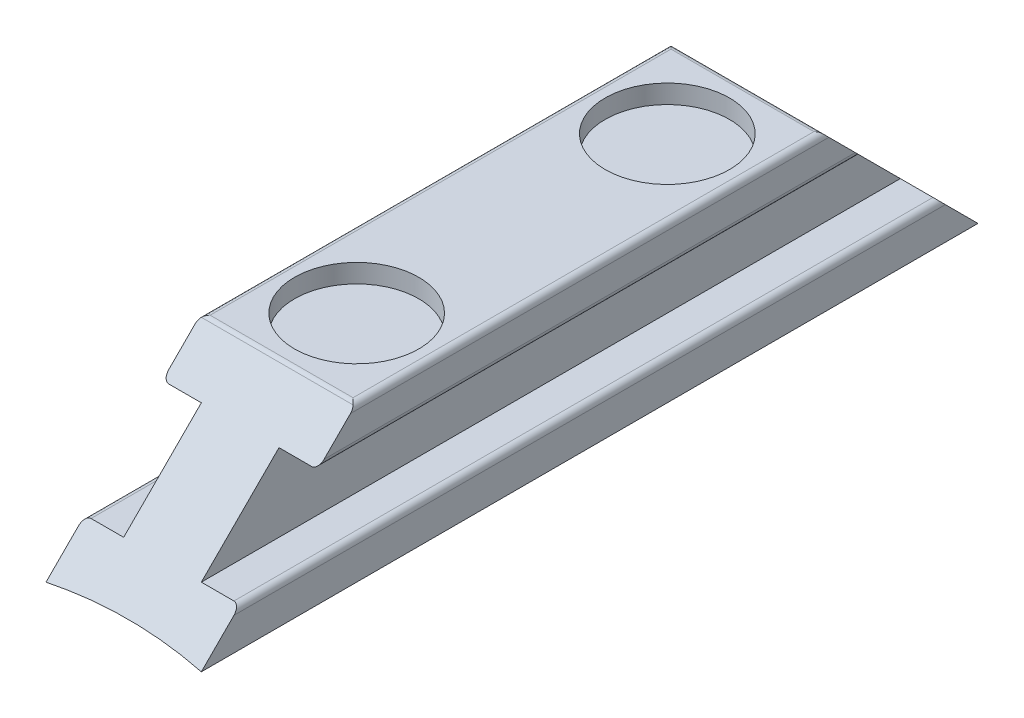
ISO-10303-21;
HEADER;
FILE_DESCRIPTION(('STEP AP214'),'2;1');
FILE_NAME('part.step','',(''),(''),'','','');
FILE_SCHEMA(('AUTOMOTIVE_DESIGN { 1 0 10303 214 1 1 1 1 }'));
ENDSEC;
DATA;
#1=APPLICATION_CONTEXT('core data for automotive mechanical design processes');
#2=APPLICATION_PROTOCOL_DEFINITION('international standard','automotive_design',2000,#1);
#3=PRODUCT_CONTEXT('',#1,'mechanical');
#4=PRODUCT('Part','Part','',(#3));
#5=PRODUCT_RELATED_PRODUCT_CATEGORY('part','',(#4));
#6=PRODUCT_DEFINITION_FORMATION('','',#4);
#7=PRODUCT_DEFINITION_CONTEXT('part definition',#1,'design');
#8=PRODUCT_DEFINITION('design','',#6,#7);
#9=PRODUCT_DEFINITION_SHAPE('','',#8);
#10=(LENGTH_UNIT() NAMED_UNIT(*) SI_UNIT(.MILLI.,.METRE.));
#11=(NAMED_UNIT(*) PLANE_ANGLE_UNIT() SI_UNIT($,.RADIAN.));
#12=(NAMED_UNIT(*) SI_UNIT($,.STERADIAN.) SOLID_ANGLE_UNIT());
#13=UNCERTAINTY_MEASURE_WITH_UNIT(LENGTH_MEASURE(1.E-05),#10,'distance_accuracy_value','');
#14=(GEOMETRIC_REPRESENTATION_CONTEXT(3) GLOBAL_UNCERTAINTY_ASSIGNED_CONTEXT((#13)) GLOBAL_UNIT_ASSIGNED_CONTEXT((#10,
#11,#12)) REPRESENTATION_CONTEXT('',''));
#15=CARTESIAN_POINT('',(0.,0.,0.));
#16=DIRECTION('',(0.,0.,1.));
#17=DIRECTION('',(1.,0.,0.));
#18=AXIS2_PLACEMENT_3D('',#15,#16,#17);
#19=CARTESIAN_POINT('',(84.3312531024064,0.,0.));
#20=DIRECTION('',(0.,0.707106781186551,-0.707106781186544));
#21=DIRECTION('',(0.,0.707106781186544,0.707106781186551));
#22=AXIS2_PLACEMENT_3D('',#19,#20,#21);
#23=PLANE('',#22);
#24=DIRECTION('',(0.,-0.707106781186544,-0.707106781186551));
#25=VECTOR('',#24,1.);
#26=CARTESIAN_POINT('',(-17.2687468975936,0.,0.));
#27=LINE('',#26,#25);
#28=CARTESIAN_POINT('',(-17.2687468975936,1.3335,1.33350000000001));
#29=VERTEX_POINT('',#28);
#30=CARTESIAN_POINT('',(-17.2687468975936,0.,0.));
#31=VERTEX_POINT('',#30);
#32=EDGE_CURVE('E564',#29,#31,#27,.T.);
#33=ORIENTED_EDGE('',*,*,#32,.F.);
#34=CARTESIAN_POINT('',(-17.0147468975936,1.3335,1.33350000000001));
#35=DIRECTION('',(0.,0.707106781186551,-0.707106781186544));
#36=DIRECTION('',(0.,0.707106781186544,0.707106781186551));
#37=AXIS2_PLACEMENT_3D('',#34,#35,#36);
#38=ELLIPSE('',#37,0.359210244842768,0.254);
#39=CARTESIAN_POINT('',(-17.0147468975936,1.5875,1.58750000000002));
#40=VERTEX_POINT('',#39);
#41=EDGE_CURVE('E223',#29,#40,#38,.T.);
#42=ORIENTED_EDGE('',*,*,#41,.T.);
#43=DIRECTION('',(-1.,0.,0.));
#44=VECTOR('',#43,1.);
#45=CARTESIAN_POINT('',(-14.0937468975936,1.5875,1.58750000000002));
#46=LINE('',#45,#44);
#47=CARTESIAN_POINT('',(-15.6812468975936,1.5875,1.58750000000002));
#48=VERTEX_POINT('',#47);
#49=EDGE_CURVE('E568',#48,#40,#46,.T.);
#50=ORIENTED_EDGE('',*,*,#49,.F.);
#51=DIRECTION('',(0.,-0.707106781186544,-0.707106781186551));
#52=VECTOR('',#51,1.);
#53=CARTESIAN_POINT('',(-15.6812468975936,13.8992893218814,13.8992893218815));
#54=LINE('',#53,#52);
#55=CARTESIAN_POINT('',(-15.6812468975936,4.7625,4.76250000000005));
#56=VERTEX_POINT('',#55);
#57=EDGE_CURVE('E571',#56,#48,#54,.T.);
#58=ORIENTED_EDGE('',*,*,#57,.F.);
#59=DIRECTION('',(-1.,0.,0.));
#60=VECTOR('',#59,1.);
#61=CARTESIAN_POINT('',(-14.0937468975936,4.7625,4.76250000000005));
#62=LINE('',#61,#60);
#63=CARTESIAN_POINT('',(-17.0147468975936,4.7625,4.76250000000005));
#64=VERTEX_POINT('',#63);
#65=EDGE_CURVE('E574',#56,#64,#62,.T.);
#66=ORIENTED_EDGE('',*,*,#65,.T.);
#67=CARTESIAN_POINT('',(-17.0147468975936,5.0165,5.01650000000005));
#68=DIRECTION('',(0.,0.707106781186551,-0.707106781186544));
#69=DIRECTION('',(0.,0.707106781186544,0.707106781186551));
#70=AXIS2_PLACEMENT_3D('',#67,#68,#69);
#71=ELLIPSE('',#70,0.359210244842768,0.254);
#72=CARTESIAN_POINT('',(-17.2687468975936,5.0165,5.01650000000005));
#73=VERTEX_POINT('',#72);
#74=EDGE_CURVE('E221',#64,#73,#71,.T.);
#75=ORIENTED_EDGE('',*,*,#74,.T.);
#76=CARTESIAN_POINT('',(-17.2687468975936,6.096,6.09600000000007));
#77=VERTEX_POINT('',#76);
#78=EDGE_CURVE('E565',#77,#73,#27,.T.);
#79=ORIENTED_EDGE('',*,*,#78,.F.);
#80=CARTESIAN_POINT('',(-17.0147468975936,6.096,6.09600000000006));
#81=DIRECTION('',(0.,0.707106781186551,-0.707106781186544));
#82=DIRECTION('',(0.,-0.707106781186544,-0.707106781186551));
#83=AXIS2_PLACEMENT_3D('',#80,#81,#82);
#84=ELLIPSE('',#83,0.359210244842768,0.254);
#85=CARTESIAN_POINT('',(-17.194352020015,6.27560512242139,6.27560512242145));
#86=VERTEX_POINT('',#85);
#87=EDGE_CURVE('E211',#77,#86,#84,.T.);
#88=ORIENTED_EDGE('',*,*,#87,.T.);
#89=DIRECTION('',(-1.,0.,0.));
#90=VECTOR('',#89,1.);
#91=CARTESIAN_POINT('',(84.3312531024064,6.27560512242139,6.27560512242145));
#92=LINE('',#91,#90);
#93=CARTESIAN_POINT('',(-10.9931417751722,6.27560512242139,6.27560512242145));
#94=VERTEX_POINT('',#93);
#95=EDGE_CURVE('E213',#86,#94,#92,.F.);
#96=ORIENTED_EDGE('',*,*,#95,.T.);
#97=CARTESIAN_POINT('',(-11.1727468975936,6.096,6.09600000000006));
#98=DIRECTION('',(0.,0.707106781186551,-0.707106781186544));
#99=DIRECTION('',(0.,-0.707106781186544,-0.707106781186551));
#100=AXIS2_PLACEMENT_3D('',#97,#98,#99);
#101=ELLIPSE('',#100,0.359210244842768,0.254);
#102=CARTESIAN_POINT('',(-10.9187468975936,6.096,6.09600000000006));
#103=VERTEX_POINT('',#102);
#104=EDGE_CURVE('E216',#94,#103,#101,.T.);
#105=ORIENTED_EDGE('',*,*,#104,.T.);
#106=DIRECTION('',(0.,0.707106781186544,0.707106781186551));
#107=VECTOR('',#106,1.);
#108=CARTESIAN_POINT('',(-10.9187468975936,13.8992893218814,13.8992893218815));
#109=LINE('',#108,#107);
#110=CARTESIAN_POINT('',(-10.9187468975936,5.0165,5.01650000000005));
#111=VERTEX_POINT('',#110);
#112=EDGE_CURVE('E577',#111,#103,#109,.T.);
#113=ORIENTED_EDGE('',*,*,#112,.F.);
#114=CARTESIAN_POINT('',(-11.1727468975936,5.0165,5.01650000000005));
#115=DIRECTION('',(0.,0.707106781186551,-0.707106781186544));
#116=DIRECTION('',(0.,-0.707106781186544,-0.707106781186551));
#117=AXIS2_PLACEMENT_3D('',#114,#115,#116);
#118=ELLIPSE('',#117,0.359210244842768,0.254);
#119=CARTESIAN_POINT('',(-11.1727468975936,4.7625,4.76250000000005));
#120=VERTEX_POINT('',#119);
#121=EDGE_CURVE('E219',#111,#120,#118,.T.);
#122=ORIENTED_EDGE('',*,*,#121,.T.);
#123=DIRECTION('',(1.,0.,0.));
#124=VECTOR('',#123,1.);
#125=CARTESIAN_POINT('',(-14.0937468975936,4.7625,4.76250000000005));
#126=LINE('',#125,#124);
#127=CARTESIAN_POINT('',(-12.5062468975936,4.7625,4.76250000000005));
#128=VERTEX_POINT('',#127);
#129=EDGE_CURVE('E268',#128,#120,#126,.T.);
#130=ORIENTED_EDGE('',*,*,#129,.F.);
#131=DIRECTION('',(0.,-0.707106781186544,-0.707106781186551));
#132=VECTOR('',#131,1.);
#133=CARTESIAN_POINT('',(-12.5062468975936,13.8992893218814,13.8992893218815));
#134=LINE('',#133,#132);
#135=CARTESIAN_POINT('',(-12.5062468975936,1.5875,1.58750000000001));
#136=VERTEX_POINT('',#135);
#137=EDGE_CURVE('E266',#128,#136,#134,.T.);
#138=ORIENTED_EDGE('',*,*,#137,.T.);
#139=DIRECTION('',(1.,0.,0.));
#140=VECTOR('',#139,1.);
#141=CARTESIAN_POINT('',(-14.0937468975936,1.5875,1.58750000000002));
#142=LINE('',#141,#140);
#143=CARTESIAN_POINT('',(-11.1727468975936,1.5875,1.58750000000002));
#144=VERTEX_POINT('',#143);
#145=EDGE_CURVE('E178',#136,#144,#142,.T.);
#146=ORIENTED_EDGE('',*,*,#145,.T.);
#147=CARTESIAN_POINT('',(-11.1727468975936,1.3335,1.33350000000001));
#148=DIRECTION('',(0.,0.707106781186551,-0.707106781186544));
#149=DIRECTION('',(0.,-0.707106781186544,-0.707106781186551));
#150=AXIS2_PLACEMENT_3D('',#147,#148,#149);
#151=ELLIPSE('',#150,0.359210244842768,0.254);
#152=CARTESIAN_POINT('',(-10.9187468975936,1.3335,1.33350000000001));
#153=VERTEX_POINT('',#152);
#154=EDGE_CURVE('E173',#144,#153,#151,.T.);
#155=ORIENTED_EDGE('',*,*,#154,.T.);
#156=DIRECTION('',(0.,-0.707106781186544,-0.707106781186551));
#157=VECTOR('',#156,1.);
#158=CARTESIAN_POINT('',(-10.9187468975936,13.8992893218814,13.8992893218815));
#159=LINE('',#158,#157);
#160=CARTESIAN_POINT('',(-10.9187468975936,0.,0.));
#161=VERTEX_POINT('',#160);
#162=EDGE_CURVE('E168',#153,#161,#159,.T.);
#163=ORIENTED_EDGE('',*,*,#162,.T.);
#164=CARTESIAN_POINT('',(-14.0937468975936,-27.599225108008,-27.5992251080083));
#165=DIRECTION('',(0.,0.707106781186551,-0.707106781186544));
#166=DIRECTION('',(0.,-0.707106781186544,-0.707106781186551));
#167=AXIS2_PLACEMENT_3D('',#164,#165,#166);
#168=ELLIPSE('',#167,39.2886205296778,27.78125);
#169=EDGE_CURVE('E171',#161,#31,#168,.F.);
#170=ORIENTED_EDGE('',*,*,#169,.T.);
#171=EDGE_LOOP('',(#33,#42,#50,#58,#66,#75,#79,#88,#96,#105,#113,#122,#130,#138,#146,#155,#163,#170));
#172=FACE_BOUND('',#171,.T.);
#173=ADVANCED_FACE('F33',(#172),#23,.T.);
#174=CARTESIAN_POINT('',(84.3312531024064,6.35,25.3999999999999));
#175=DIRECTION('',(0.,0.707106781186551,0.707106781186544));
#176=DIRECTION('',(0.,-0.707106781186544,0.707106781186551));
#177=AXIS2_PLACEMENT_3D('',#174,#175,#176);
#178=PLANE('',#177);
#179=DIRECTION('',(1.,0.,0.));
#180=VECTOR('',#179,1.);
#181=CARTESIAN_POINT('',(-14.0937468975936,1.5875,30.1625));
#182=LINE('',#181,#180);
#183=CARTESIAN_POINT('',(-17.0147468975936,1.5875,30.1625));
#184=VERTEX_POINT('',#183);
#185=CARTESIAN_POINT('',(-15.6812468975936,1.5875,30.1625));
#186=VERTEX_POINT('',#185);
#187=EDGE_CURVE('E177',#184,#186,#182,.T.);
#188=ORIENTED_EDGE('',*,*,#187,.F.);
#189=CARTESIAN_POINT('',(-17.0147468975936,1.3335,30.4165));
#190=DIRECTION('',(0.,0.707106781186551,0.707106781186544));
#191=DIRECTION('',(0.,-0.707106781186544,0.707106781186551));
#192=AXIS2_PLACEMENT_3D('',#189,#190,#191);
#193=ELLIPSE('',#192,0.359210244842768,0.254);
#194=CARTESIAN_POINT('',(-17.2687468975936,1.3335,30.4165));
#195=VERTEX_POINT('',#194);
#196=EDGE_CURVE('E235',#184,#195,#193,.T.);
#197=ORIENTED_EDGE('',*,*,#196,.T.);
#198=DIRECTION('',(0.,0.707106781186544,-0.707106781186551));
#199=VECTOR('',#198,1.);
#200=CARTESIAN_POINT('',(-17.2687468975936,6.35,25.3999999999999));
#201=LINE('',#200,#199);
#202=CARTESIAN_POINT('',(-17.2687468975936,0.,31.75));
#203=VERTEX_POINT('',#202);
#204=EDGE_CURVE('E561',#203,#195,#201,.T.);
#205=ORIENTED_EDGE('',*,*,#204,.F.);
#206=CARTESIAN_POINT('',(-14.0937468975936,-27.599225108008,59.3492251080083));
#207=DIRECTION('',(0.,0.707106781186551,0.707106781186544));
#208=DIRECTION('',(0.,0.707106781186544,-0.707106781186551));
#209=AXIS2_PLACEMENT_3D('',#206,#207,#208);
#210=ELLIPSE('',#209,39.2886205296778,27.78125);
#211=CARTESIAN_POINT('',(-10.9187468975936,0.,31.75));
#212=VERTEX_POINT('',#211);
#213=EDGE_CURVE('E193',#203,#212,#210,.F.);
#214=ORIENTED_EDGE('',*,*,#213,.T.);
#215=DIRECTION('',(0.,0.707106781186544,-0.707106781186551));
#216=VECTOR('',#215,1.);
#217=CARTESIAN_POINT('',(-10.9187468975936,-1.97571067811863,33.7257106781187));
#218=LINE('',#217,#216);
#219=CARTESIAN_POINT('',(-10.9187468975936,1.3335,30.4165));
#220=VERTEX_POINT('',#219);
#221=EDGE_CURVE('E192',#212,#220,#218,.T.);
#222=ORIENTED_EDGE('',*,*,#221,.T.);
#223=CARTESIAN_POINT('',(-11.1727468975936,1.3335,30.4165));
#224=DIRECTION('',(0.,0.707106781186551,0.707106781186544));
#225=DIRECTION('',(0.,0.707106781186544,-0.707106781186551));
#226=AXIS2_PLACEMENT_3D('',#223,#224,#225);
#227=ELLIPSE('',#226,0.359210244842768,0.254);
#228=CARTESIAN_POINT('',(-11.1727468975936,1.5875,30.1625));
#229=VERTEX_POINT('',#228);
#230=EDGE_CURVE('E229',#220,#229,#227,.T.);
#231=ORIENTED_EDGE('',*,*,#230,.T.);
#232=DIRECTION('',(-1.,0.,0.));
#233=VECTOR('',#232,1.);
#234=CARTESIAN_POINT('',(-14.0937468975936,1.5875,30.1625));
#235=LINE('',#234,#233);
#236=CARTESIAN_POINT('',(-12.5062468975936,1.5875,30.1625));
#237=VERTEX_POINT('',#236);
#238=EDGE_CURVE('E262',#229,#237,#235,.T.);
#239=ORIENTED_EDGE('',*,*,#238,.T.);
#240=DIRECTION('',(0.,0.707106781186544,-0.707106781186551));
#241=VECTOR('',#240,1.);
#242=CARTESIAN_POINT('',(-12.5062468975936,-1.97571067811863,33.7257106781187));
#243=LINE('',#242,#241);
#244=CARTESIAN_POINT('',(-12.5062468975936,4.7625,26.9874999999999));
#245=VERTEX_POINT('',#244);
#246=EDGE_CURVE('E283',#237,#245,#243,.T.);
#247=ORIENTED_EDGE('',*,*,#246,.T.);
#248=DIRECTION('',(-1.,0.,0.));
#249=VECTOR('',#248,1.);
#250=CARTESIAN_POINT('',(-14.0937468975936,4.7625,26.9874999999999));
#251=LINE('',#250,#249);
#252=CARTESIAN_POINT('',(-11.1727468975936,4.7625,26.9874999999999));
#253=VERTEX_POINT('',#252);
#254=EDGE_CURVE('E281',#253,#245,#251,.T.);
#255=ORIENTED_EDGE('',*,*,#254,.F.);
#256=CARTESIAN_POINT('',(-11.1727468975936,5.0165,26.7334999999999));
#257=DIRECTION('',(0.,0.707106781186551,0.707106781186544));
#258=DIRECTION('',(0.,0.707106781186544,-0.707106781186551));
#259=AXIS2_PLACEMENT_3D('',#256,#257,#258);
#260=ELLIPSE('',#259,0.359210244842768,0.254);
#261=CARTESIAN_POINT('',(-10.9187468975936,5.0165,26.7334999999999));
#262=VERTEX_POINT('',#261);
#263=EDGE_CURVE('E231',#253,#262,#260,.T.);
#264=ORIENTED_EDGE('',*,*,#263,.T.);
#265=DIRECTION('',(0.,-0.707106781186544,0.707106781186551));
#266=VECTOR('',#265,1.);
#267=CARTESIAN_POINT('',(-10.9187468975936,-1.97571067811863,33.7257106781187));
#268=LINE('',#267,#266);
#269=CARTESIAN_POINT('',(-10.9187468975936,6.096,25.6539999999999));
#270=VERTEX_POINT('',#269);
#271=EDGE_CURVE('E278',#270,#262,#268,.T.);
#272=ORIENTED_EDGE('',*,*,#271,.F.);
#273=CARTESIAN_POINT('',(-11.1727468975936,6.096,25.6539999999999));
#274=DIRECTION('',(0.,0.707106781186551,0.707106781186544));
#275=DIRECTION('',(0.,0.707106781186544,-0.707106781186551));
#276=AXIS2_PLACEMENT_3D('',#273,#274,#275);
#277=ELLIPSE('',#276,0.359210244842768,0.254);
#278=CARTESIAN_POINT('',(-10.9931417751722,6.27560512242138,25.4743948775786));
#279=VERTEX_POINT('',#278);
#280=EDGE_CURVE('E48',#270,#279,#277,.T.);
#281=ORIENTED_EDGE('',*,*,#280,.T.);
#282=DIRECTION('',(-1.,0.,0.));
#283=VECTOR('',#282,1.);
#284=CARTESIAN_POINT('',(84.3312531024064,6.27560512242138,25.4743948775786));
#285=LINE('',#284,#283);
#286=CARTESIAN_POINT('',(-17.194352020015,6.27560512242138,25.4743948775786));
#287=VERTEX_POINT('',#286);
#288=EDGE_CURVE('E52',#279,#287,#285,.T.);
#289=ORIENTED_EDGE('',*,*,#288,.T.);
#290=CARTESIAN_POINT('',(-17.0147468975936,6.096,25.6539999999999));
#291=DIRECTION('',(0.,0.707106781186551,0.707106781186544));
#292=DIRECTION('',(0.,0.707106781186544,-0.707106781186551));
#293=AXIS2_PLACEMENT_3D('',#290,#291,#292);
#294=ELLIPSE('',#293,0.359210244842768,0.254);
#295=CARTESIAN_POINT('',(-17.2687468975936,6.096,25.6539999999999));
#296=VERTEX_POINT('',#295);
#297=EDGE_CURVE('E225',#287,#296,#294,.T.);
#298=ORIENTED_EDGE('',*,*,#297,.T.);
#299=CARTESIAN_POINT('',(-17.2687468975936,5.0165,26.7334999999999));
#300=VERTEX_POINT('',#299);
#301=EDGE_CURVE('E187',#300,#296,#201,.T.);
#302=ORIENTED_EDGE('',*,*,#301,.F.);
#303=CARTESIAN_POINT('',(-17.0147468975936,5.0165,26.7334999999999));
#304=DIRECTION('',(0.,0.707106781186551,0.707106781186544));
#305=DIRECTION('',(0.,-0.707106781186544,0.707106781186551));
#306=AXIS2_PLACEMENT_3D('',#303,#304,#305);
#307=ELLIPSE('',#306,0.359210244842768,0.254);
#308=CARTESIAN_POINT('',(-17.0147468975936,4.7625,26.9874999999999));
#309=VERTEX_POINT('',#308);
#310=EDGE_CURVE('E233',#300,#309,#307,.T.);
#311=ORIENTED_EDGE('',*,*,#310,.T.);
#312=DIRECTION('',(1.,0.,0.));
#313=VECTOR('',#312,1.);
#314=CARTESIAN_POINT('',(-14.0937468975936,4.7625,26.9874999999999));
#315=LINE('',#314,#313);
#316=CARTESIAN_POINT('',(-15.6812468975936,4.7625,26.9874999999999));
#317=VERTEX_POINT('',#316);
#318=EDGE_CURVE('E276',#309,#317,#315,.T.);
#319=ORIENTED_EDGE('',*,*,#318,.T.);
#320=DIRECTION('',(0.,0.707106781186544,-0.707106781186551));
#321=VECTOR('',#320,1.);
#322=CARTESIAN_POINT('',(-15.6812468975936,-1.97571067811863,33.7257106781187));
#323=LINE('',#322,#321);
#324=EDGE_CURVE('E273',#186,#317,#323,.T.);
#325=ORIENTED_EDGE('',*,*,#324,.F.);
#326=EDGE_LOOP('',(#188,#197,#205,#214,#222,#231,#239,#247,#255,#264,#272,#281,#289,#298,#302,
#311,#319,#325));
#327=FACE_BOUND('',#326,.T.);
#328=ADVANCED_FACE('F305',(#327),#178,.T.);
#329=CARTESIAN_POINT('',(-10.9187468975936,-3.95142135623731,31.75));
#330=DIRECTION('',(-1.,0.,0.));
#331=DIRECTION('',(0.,-1.,0.));
#332=AXIS2_PLACEMENT_3D('',#329,#330,#331);
#333=PLANE('',#332);
#334=ORIENTED_EDGE('',*,*,#162,.F.);
#335=DIRECTION('',(0.,0.,-1.));
#336=VECTOR('',#335,1.);
#337=CARTESIAN_POINT('',(-10.9187468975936,1.3335,31.75));
#338=LINE('',#337,#336);
#339=EDGE_CURVE('E13',#153,#220,#338,.F.);
#340=ORIENTED_EDGE('',*,*,#339,.T.);
#341=ORIENTED_EDGE('',*,*,#221,.F.);
#342=DIRECTION('',(0.,0.,-1.));
#343=VECTOR('',#342,1.);
#344=CARTESIAN_POINT('',(-10.9187468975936,0.,31.75));
#345=LINE('',#344,#343);
#346=EDGE_CURVE('E183',#212,#161,#345,.T.);
#347=ORIENTED_EDGE('',*,*,#346,.T.);
#348=EDGE_LOOP('',(#334,#340,#341,#347));
#349=FACE_BOUND('',#348,.T.);
#350=ADVANCED_FACE('F35',(#349),#333,.F.);
#351=CARTESIAN_POINT('',(-14.0937468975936,1.5875,31.75));
#352=DIRECTION('',(0.,-1.,0.));
#353=DIRECTION('',(1.,0.,0.));
#354=AXIS2_PLACEMENT_3D('',#351,#352,#353);
#355=PLANE('',#354);
#356=ORIENTED_EDGE('',*,*,#238,.F.);
#357=DIRECTION('',(0.,0.,-1.));
#358=VECTOR('',#357,1.);
#359=CARTESIAN_POINT('',(-11.1727468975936,1.5875,31.75));
#360=LINE('',#359,#358);
#361=EDGE_CURVE('E41',#229,#144,#360,.T.);
#362=ORIENTED_EDGE('',*,*,#361,.T.);
#363=ORIENTED_EDGE('',*,*,#145,.F.);
#364=DIRECTION('',(0.,0.,-1.));
#365=VECTOR('',#364,1.);
#366=CARTESIAN_POINT('',(-12.5062468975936,1.5875,31.75));
#367=LINE('',#366,#365);
#368=EDGE_CURVE('E194',#237,#136,#367,.T.);
#369=ORIENTED_EDGE('',*,*,#368,.F.);
#370=EDGE_LOOP('',(#356,#362,#363,#369));
#371=FACE_BOUND('',#370,.T.);
#372=ADVANCED_FACE('F260',(#371),#355,.F.);
#373=CARTESIAN_POINT('',(-12.5062468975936,-3.95142135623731,31.75));
#374=DIRECTION('',(-1.,0.,0.));
#375=DIRECTION('',(0.,0.,1.));
#376=AXIS2_PLACEMENT_3D('',#373,#374,#375);
#377=PLANE('',#376);
#378=ORIENTED_EDGE('',*,*,#137,.F.);
#379=DIRECTION('',(0.,0.,-1.));
#380=VECTOR('',#379,1.);
#381=CARTESIAN_POINT('',(-12.5062468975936,4.7625,31.75));
#382=LINE('',#381,#380);
#383=EDGE_CURVE('E199',#245,#128,#382,.T.);
#384=ORIENTED_EDGE('',*,*,#383,.F.);
#385=ORIENTED_EDGE('',*,*,#246,.F.);
#386=ORIENTED_EDGE('',*,*,#368,.T.);
#387=EDGE_LOOP('',(#378,#384,#385,#386));
#388=FACE_BOUND('',#387,.T.);
#389=ADVANCED_FACE('F303',(#388),#377,.F.);
#390=CARTESIAN_POINT('',(-14.0937468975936,4.7625,31.75));
#391=DIRECTION('',(0.,-1.,0.));
#392=DIRECTION('',(1.,0.,0.));
#393=AXIS2_PLACEMENT_3D('',#390,#391,#392);
#394=PLANE('',#393);
#395=ORIENTED_EDGE('',*,*,#129,.T.);
#396=DIRECTION('',(0.,0.,-1.));
#397=VECTOR('',#396,1.);
#398=CARTESIAN_POINT('',(-11.1727468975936,4.7625,31.75));
#399=LINE('',#398,#397);
#400=EDGE_CURVE('E254',#120,#253,#399,.F.);
#401=ORIENTED_EDGE('',*,*,#400,.T.);
#402=ORIENTED_EDGE('',*,*,#254,.T.);
#403=ORIENTED_EDGE('',*,*,#383,.T.);
#404=EDGE_LOOP('',(#395,#401,#402,#403));
#405=FACE_BOUND('',#404,.T.);
#406=ADVANCED_FACE('F298',(#405),#394,.T.);
#407=CARTESIAN_POINT('',(-10.9187468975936,-3.95142135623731,31.75));
#408=DIRECTION('',(1.,0.,0.));
#409=DIRECTION('',(0.,0.,-1.));
#410=AXIS2_PLACEMENT_3D('',#407,#408,#409);
#411=PLANE('',#410);
#412=ORIENTED_EDGE('',*,*,#271,.T.);
#413=DIRECTION('',(0.,0.,-1.));
#414=VECTOR('',#413,1.);
#415=CARTESIAN_POINT('',(-10.9187468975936,5.0165,31.75));
#416=LINE('',#415,#414);
#417=EDGE_CURVE('E251',#262,#111,#416,.T.);
#418=ORIENTED_EDGE('',*,*,#417,.T.);
#419=ORIENTED_EDGE('',*,*,#112,.T.);
#420=DIRECTION('',(0.,0.,-1.));
#421=VECTOR('',#420,1.);
#422=CARTESIAN_POINT('',(-10.9187468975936,6.096,31.75));
#423=LINE('',#422,#421);
#424=EDGE_CURVE('E249',#103,#270,#423,.F.);
#425=ORIENTED_EDGE('',*,*,#424,.T.);
#426=EDGE_LOOP('',(#412,#418,#419,#425));
#427=FACE_BOUND('',#426,.T.);
#428=ADVANCED_FACE('F354',(#427),#411,.T.);
#429=CARTESIAN_POINT('',(-14.0937468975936,6.35,31.75));
#430=DIRECTION('',(0.,1.,0.));
#431=DIRECTION('',(0.,0.,1.));
#432=AXIS2_PLACEMENT_3D('',#429,#430,#431);
#433=PLANE('',#432);
#434=CARTESIAN_POINT('',(-14.0937468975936,6.35,22.2250000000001));
#435=DIRECTION('',(0.,1.,0.));
#436=DIRECTION('',(0.,0.,1.));
#437=AXIS2_PLACEMENT_3D('',#434,#435,#436);
#438=CIRCLE('',#437,2.54);
#439=CARTESIAN_POINT('',(-14.0937468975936,6.35,24.7650000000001));
#440=VERTEX_POINT('',#439);
#441=EDGE_CURVE('E542',#440,#440,#438,.T.);
#442=ORIENTED_EDGE('',*,*,#441,.F.);
#443=EDGE_LOOP('',(#442));
#444=FACE_BOUND('',#443,.T.);
#445=CARTESIAN_POINT('',(-14.0937468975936,6.35,9.52500000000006));
#446=DIRECTION('',(0.,1.,0.));
#447=DIRECTION('',(0.,0.,1.));
#448=AXIS2_PLACEMENT_3D('',#445,#446,#447);
#449=CIRCLE('',#448,2.54);
#450=CARTESIAN_POINT('',(-14.0937468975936,6.35,12.0650000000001));
#451=VERTEX_POINT('',#450);
#452=EDGE_CURVE('E541',#451,#451,#449,.T.);
#453=ORIENTED_EDGE('',*,*,#452,.F.);
#454=EDGE_LOOP('',(#453));
#455=FACE_BOUND('',#454,.T.);
#456=DIRECTION('',(-1.,0.,0.));
#457=VECTOR('',#456,1.);
#458=CARTESIAN_POINT('',(-14.0937468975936,6.35,25.2947897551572));
#459=LINE('',#458,#457);
#460=CARTESIAN_POINT('',(-17.0147468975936,6.35,25.2947897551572));
#461=VERTEX_POINT('',#460);
#462=CARTESIAN_POINT('',(-11.1727468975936,6.35,25.2947897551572));
#463=VERTEX_POINT('',#462);
#464=EDGE_CURVE('E204',#461,#463,#459,.F.);
#465=ORIENTED_EDGE('',*,*,#464,.T.);
#466=DIRECTION('',(0.,0.,-1.));
#467=VECTOR('',#466,1.);
#468=CARTESIAN_POINT('',(-11.1727468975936,6.35,31.75));
#469=LINE('',#468,#467);
#470=CARTESIAN_POINT('',(-11.1727468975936,6.35,6.45521024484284));
#471=VERTEX_POINT('',#470);
#472=EDGE_CURVE('E209',#463,#471,#469,.T.);
#473=ORIENTED_EDGE('',*,*,#472,.T.);
#474=DIRECTION('',(-1.,0.,0.));
#475=VECTOR('',#474,1.);
#476=CARTESIAN_POINT('',(-14.0937468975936,6.35,6.45521024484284));
#477=LINE('',#476,#475);
#478=CARTESIAN_POINT('',(-17.0147468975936,6.35,6.45521024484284));
#479=VERTEX_POINT('',#478);
#480=EDGE_CURVE('E206',#471,#479,#477,.T.);
#481=ORIENTED_EDGE('',*,*,#480,.T.);
#482=DIRECTION('',(0.,0.,-1.));
#483=VECTOR('',#482,1.);
#484=CARTESIAN_POINT('',(-17.0147468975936,6.35,31.75));
#485=LINE('',#484,#483);
#486=EDGE_CURVE('E196',#479,#461,#485,.F.);
#487=ORIENTED_EDGE('',*,*,#486,.T.);
#488=EDGE_LOOP('',(#465,#473,#481,#487));
#489=FACE_BOUND('',#488,.T.);
#490=ADVANCED_FACE('F350',(#444,#455,#489),#433,.T.);
#491=CARTESIAN_POINT('',(-17.2687468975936,-3.95142135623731,31.75));
#492=DIRECTION('',(-1.,0.,0.));
#493=DIRECTION('',(0.,0.,1.));
#494=AXIS2_PLACEMENT_3D('',#491,#492,#493);
#495=PLANE('',#494);
#496=ORIENTED_EDGE('',*,*,#78,.T.);
#497=DIRECTION('',(0.,0.,-1.));
#498=VECTOR('',#497,1.);
#499=CARTESIAN_POINT('',(-17.2687468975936,5.0165,26.9874999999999));
#500=LINE('',#499,#498);
#501=EDGE_CURVE('E247',#73,#300,#500,.F.);
#502=ORIENTED_EDGE('',*,*,#501,.T.);
#503=ORIENTED_EDGE('',*,*,#301,.T.);
#504=DIRECTION('',(0.,0.,-1.));
#505=VECTOR('',#504,1.);
#506=CARTESIAN_POINT('',(-17.2687468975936,6.096,31.75));
#507=LINE('',#506,#505);
#508=EDGE_CURVE('E245',#296,#77,#507,.T.);
#509=ORIENTED_EDGE('',*,*,#508,.T.);
#510=EDGE_LOOP('',(#496,#502,#503,#509));
#511=FACE_BOUND('',#510,.T.);
#512=ADVANCED_FACE('F346',(#511),#495,.T.);
#513=CARTESIAN_POINT('',(-14.0937468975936,4.7625,31.75));
#514=DIRECTION('',(0.,1.,0.));
#515=DIRECTION('',(0.,0.,1.));
#516=AXIS2_PLACEMENT_3D('',#513,#514,#515);
#517=PLANE('',#516);
#518=ORIENTED_EDGE('',*,*,#318,.F.);
#519=DIRECTION('',(0.,0.,-1.));
#520=VECTOR('',#519,1.);
#521=CARTESIAN_POINT('',(-17.0147468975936,4.7625,4.76250000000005));
#522=LINE('',#521,#520);
#523=EDGE_CURVE('E242',#309,#64,#522,.T.);
#524=ORIENTED_EDGE('',*,*,#523,.T.);
#525=ORIENTED_EDGE('',*,*,#65,.F.);
#526=DIRECTION('',(0.,0.,-1.));
#527=VECTOR('',#526,1.);
#528=CARTESIAN_POINT('',(-15.6812468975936,4.7625,31.75));
#529=LINE('',#528,#527);
#530=EDGE_CURVE('E292',#317,#56,#529,.T.);
#531=ORIENTED_EDGE('',*,*,#530,.F.);
#532=EDGE_LOOP('',(#518,#524,#525,#531));
#533=FACE_BOUND('',#532,.T.);
#534=ADVANCED_FACE('F342',(#533),#517,.F.);
#535=CARTESIAN_POINT('',(-15.6812468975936,-3.95142135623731,31.75));
#536=DIRECTION('',(-1.,0.,0.));
#537=DIRECTION('',(0.,0.,1.));
#538=AXIS2_PLACEMENT_3D('',#535,#536,#537);
#539=PLANE('',#538);
#540=ORIENTED_EDGE('',*,*,#530,.T.);
#541=ORIENTED_EDGE('',*,*,#57,.T.);
#542=DIRECTION('',(0.,0.,-1.));
#543=VECTOR('',#542,1.);
#544=CARTESIAN_POINT('',(-15.6812468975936,1.5875,31.75));
#545=LINE('',#544,#543);
#546=EDGE_CURVE('E289',#186,#48,#545,.T.);
#547=ORIENTED_EDGE('',*,*,#546,.F.);
#548=ORIENTED_EDGE('',*,*,#324,.T.);
#549=EDGE_LOOP('',(#540,#541,#547,#548));
#550=FACE_BOUND('',#549,.T.);
#551=ADVANCED_FACE('F338',(#550),#539,.T.);
#552=CARTESIAN_POINT('',(-14.0937468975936,1.5875,31.75));
#553=DIRECTION('',(0.,1.,0.));
#554=DIRECTION('',(0.,0.,1.));
#555=AXIS2_PLACEMENT_3D('',#552,#553,#554);
#556=PLANE('',#555);
#557=ORIENTED_EDGE('',*,*,#49,.T.);
#558=DIRECTION('',(0.,0.,-1.));
#559=VECTOR('',#558,1.);
#560=CARTESIAN_POINT('',(-17.0147468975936,1.5875,30.1625));
#561=LINE('',#560,#559);
#562=EDGE_CURVE('E240',#40,#184,#561,.F.);
#563=ORIENTED_EDGE('',*,*,#562,.T.);
#564=ORIENTED_EDGE('',*,*,#187,.T.);
#565=ORIENTED_EDGE('',*,*,#546,.T.);
#566=EDGE_LOOP('',(#557,#563,#564,#565));
#567=FACE_BOUND('',#566,.T.);
#568=ADVANCED_FACE('F334',(#567),#556,.T.);
#569=CARTESIAN_POINT('',(-17.2687468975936,-3.95142135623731,31.75));
#570=DIRECTION('',(1.,0.,0.));
#571=DIRECTION('',(0.,0.,-1.));
#572=AXIS2_PLACEMENT_3D('',#569,#570,#571);
#573=PLANE('',#572);
#574=ORIENTED_EDGE('',*,*,#204,.T.);
#575=DIRECTION('',(0.,0.,-1.));
#576=VECTOR('',#575,1.);
#577=CARTESIAN_POINT('',(-17.2687468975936,1.3335,1.58750000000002));
#578=LINE('',#577,#576);
#579=EDGE_CURVE('E237',#195,#29,#578,.T.);
#580=ORIENTED_EDGE('',*,*,#579,.T.);
#581=ORIENTED_EDGE('',*,*,#32,.T.);
#582=DIRECTION('',(0.,0.,-1.));
#583=VECTOR('',#582,1.);
#584=CARTESIAN_POINT('',(-17.2687468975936,0.,31.75));
#585=LINE('',#584,#583);
#586=EDGE_CURVE('E186',#203,#31,#585,.T.);
#587=ORIENTED_EDGE('',*,*,#586,.F.);
#588=EDGE_LOOP('',(#574,#580,#581,#587));
#589=FACE_BOUND('',#588,.T.);
#590=ADVANCED_FACE('F331',(#589),#573,.F.);
#591=CARTESIAN_POINT('',(-14.0937468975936,-27.599225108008,101.6));
#592=DIRECTION('',(0.,0.,-1.));
#593=DIRECTION('',(-1.,0.,0.));
#594=AXIS2_PLACEMENT_3D('',#591,#592,#593);
#595=CYLINDRICAL_SURFACE('',#594,27.78125);
#596=ORIENTED_EDGE('',*,*,#346,.F.);
#597=ORIENTED_EDGE('',*,*,#213,.F.);
#598=ORIENTED_EDGE('',*,*,#586,.T.);
#599=ORIENTED_EDGE('',*,*,#169,.F.);
#600=EDGE_LOOP('',(#596,#597,#598,#599));
#601=FACE_BOUND('',#600,.T.);
#602=ADVANCED_FACE('F182',(#601),#595,.F.);
#603=CARTESIAN_POINT('',(84.3312531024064,6.096,25.2947897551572));
#604=DIRECTION('',(-1.,0.,0.));
#605=DIRECTION('',(0.,0.,1.));
#606=AXIS2_PLACEMENT_3D('',#603,#604,#605);
#607=CYLINDRICAL_SURFACE('',#606,0.254);
#608=CARTESIAN_POINT('',(-17.0147468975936,6.096,25.2947897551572));
#609=DIRECTION('',(-0.707106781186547,0.,-0.707106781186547));
#610=DIRECTION('',(0.707106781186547,0.,-0.707106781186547));
#611=AXIS2_PLACEMENT_3D('',#608,#609,#610);
#612=ELLIPSE('',#611,0.359210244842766,0.254);
#613=EDGE_CURVE('E556',#287,#461,#612,.T.);
#614=ORIENTED_EDGE('',*,*,#613,.F.);
#615=ORIENTED_EDGE('',*,*,#288,.F.);
#616=CARTESIAN_POINT('',(-11.1727468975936,6.096,25.2947897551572));
#617=DIRECTION('',(0.707106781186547,0.,-0.707106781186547));
#618=DIRECTION('',(-0.707106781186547,0.,-0.707106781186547));
#619=AXIS2_PLACEMENT_3D('',#616,#617,#618);
#620=ELLIPSE('',#619,0.359210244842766,0.254);
#621=EDGE_CURVE('E188',#463,#279,#620,.T.);
#622=ORIENTED_EDGE('',*,*,#621,.F.);
#623=ORIENTED_EDGE('',*,*,#464,.F.);
#624=EDGE_LOOP('',(#614,#615,#622,#623));
#625=FACE_BOUND('',#624,.T.);
#626=ADVANCED_FACE('F385',(#625),#607,.T.);
#627=CARTESIAN_POINT('',(-11.1727468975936,6.096,31.75));
#628=DIRECTION('',(0.,0.,-1.));
#629=DIRECTION('',(-1.,0.,0.));
#630=AXIS2_PLACEMENT_3D('',#627,#628,#629);
#631=CYLINDRICAL_SURFACE('',#630,0.254);
#632=ORIENTED_EDGE('',*,*,#424,.F.);
#633=ORIENTED_EDGE('',*,*,#104,.F.);
#634=CARTESIAN_POINT('',(-11.1727468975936,6.096,6.45521024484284));
#635=DIRECTION('',(-0.707106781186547,0.,-0.707106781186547));
#636=DIRECTION('',(0.707106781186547,0.,-0.707106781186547));
#637=AXIS2_PLACEMENT_3D('',#634,#635,#636);
#638=ELLIPSE('',#637,0.359210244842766,0.254);
#639=EDGE_CURVE('E554',#471,#94,#638,.T.);
#640=ORIENTED_EDGE('',*,*,#639,.F.);
#641=ORIENTED_EDGE('',*,*,#472,.F.);
#642=ORIENTED_EDGE('',*,*,#621,.T.);
#643=ORIENTED_EDGE('',*,*,#280,.F.);
#644=EDGE_LOOP('',(#632,#633,#640,#641,#642,#643));
#645=FACE_BOUND('',#644,.T.);
#646=ADVANCED_FACE('F442',(#645),#631,.T.);
#647=CARTESIAN_POINT('',(-17.0147468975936,6.096,31.75));
#648=DIRECTION('',(0.,0.,-1.));
#649=DIRECTION('',(-1.,0.,0.));
#650=AXIS2_PLACEMENT_3D('',#647,#648,#649);
#651=CYLINDRICAL_SURFACE('',#650,0.254);
#652=ORIENTED_EDGE('',*,*,#613,.T.);
#653=ORIENTED_EDGE('',*,*,#486,.F.);
#654=CARTESIAN_POINT('',(-17.0147468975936,6.096,6.45521024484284));
#655=DIRECTION('',(0.707106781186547,0.,-0.707106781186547));
#656=DIRECTION('',(-0.707106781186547,0.,-0.707106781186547));
#657=AXIS2_PLACEMENT_3D('',#654,#655,#656);
#658=ELLIPSE('',#657,0.359210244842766,0.254);
#659=EDGE_CURVE('E552',#86,#479,#658,.T.);
#660=ORIENTED_EDGE('',*,*,#659,.F.);
#661=ORIENTED_EDGE('',*,*,#87,.F.);
#662=ORIENTED_EDGE('',*,*,#508,.F.);
#663=ORIENTED_EDGE('',*,*,#297,.F.);
#664=EDGE_LOOP('',(#652,#653,#660,#661,#662,#663));
#665=FACE_BOUND('',#664,.T.);
#666=ADVANCED_FACE('F451',(#665),#651,.T.);
#667=CARTESIAN_POINT('',(-14.0937468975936,6.096,6.45521024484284));
#668=DIRECTION('',(-1.,0.,0.));
#669=DIRECTION('',(0.,0.,1.));
#670=AXIS2_PLACEMENT_3D('',#667,#668,#669);
#671=CYLINDRICAL_SURFACE('',#670,0.254);
#672=ORIENTED_EDGE('',*,*,#639,.T.);
#673=ORIENTED_EDGE('',*,*,#95,.F.);
#674=ORIENTED_EDGE('',*,*,#659,.T.);
#675=ORIENTED_EDGE('',*,*,#480,.F.);
#676=EDGE_LOOP('',(#672,#673,#674,#675));
#677=FACE_BOUND('',#676,.T.);
#678=ADVANCED_FACE('F461',(#677),#671,.T.);
#679=CARTESIAN_POINT('',(-17.0147468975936,1.3335,31.75));
#680=DIRECTION('',(0.,0.,1.));
#681=DIRECTION('',(1.,0.,0.));
#682=AXIS2_PLACEMENT_3D('',#679,#680,#681);
#683=CYLINDRICAL_SURFACE('',#682,0.254);
#684=ORIENTED_EDGE('',*,*,#196,.F.);
#685=ORIENTED_EDGE('',*,*,#562,.F.);
#686=ORIENTED_EDGE('',*,*,#41,.F.);
#687=ORIENTED_EDGE('',*,*,#579,.F.);
#688=EDGE_LOOP('',(#684,#685,#686,#687));
#689=FACE_BOUND('',#688,.T.);
#690=ADVANCED_FACE('F471',(#689),#683,.T.);
#691=CARTESIAN_POINT('',(-17.0147468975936,5.0165,31.75));
#692=DIRECTION('',(0.,0.,1.));
#693=DIRECTION('',(1.,0.,0.));
#694=AXIS2_PLACEMENT_3D('',#691,#692,#693);
#695=CYLINDRICAL_SURFACE('',#694,0.254);
#696=ORIENTED_EDGE('',*,*,#310,.F.);
#697=ORIENTED_EDGE('',*,*,#501,.F.);
#698=ORIENTED_EDGE('',*,*,#74,.F.);
#699=ORIENTED_EDGE('',*,*,#523,.F.);
#700=EDGE_LOOP('',(#696,#697,#698,#699));
#701=FACE_BOUND('',#700,.T.);
#702=ADVANCED_FACE('F319',(#701),#695,.T.);
#703=CARTESIAN_POINT('',(-11.1727468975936,5.0165,31.75));
#704=DIRECTION('',(0.,0.,-1.));
#705=DIRECTION('',(-1.,0.,0.));
#706=AXIS2_PLACEMENT_3D('',#703,#704,#705);
#707=CYLINDRICAL_SURFACE('',#706,0.254);
#708=ORIENTED_EDGE('',*,*,#263,.F.);
#709=ORIENTED_EDGE('',*,*,#400,.F.);
#710=ORIENTED_EDGE('',*,*,#121,.F.);
#711=ORIENTED_EDGE('',*,*,#417,.F.);
#712=EDGE_LOOP('',(#708,#709,#710,#711));
#713=FACE_BOUND('',#712,.T.);
#714=ADVANCED_FACE('F310',(#713),#707,.T.);
#715=CARTESIAN_POINT('',(-11.1727468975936,1.3335,31.75));
#716=DIRECTION('',(0.,0.,-1.));
#717=DIRECTION('',(-1.,0.,0.));
#718=AXIS2_PLACEMENT_3D('',#715,#716,#717);
#719=CYLINDRICAL_SURFACE('',#718,0.254);
#720=ORIENTED_EDGE('',*,*,#230,.F.);
#721=ORIENTED_EDGE('',*,*,#339,.F.);
#722=ORIENTED_EDGE('',*,*,#154,.F.);
#723=ORIENTED_EDGE('',*,*,#361,.F.);
#724=EDGE_LOOP('',(#720,#721,#722,#723));
#725=FACE_BOUND('',#724,.T.);
#726=ADVANCED_FACE('F307',(#725),#719,.T.);
#727=CARTESIAN_POINT('',(-14.0937468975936,5.588,9.52500000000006));
#728=DIRECTION('',(0.,1.,0.));
#729=DIRECTION('',(0.,0.,1.));
#730=AXIS2_PLACEMENT_3D('',#727,#728,#729);
#731=CYLINDRICAL_SURFACE('',#730,2.54);
#732=CARTESIAN_POINT('',(-14.0937468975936,5.588,9.52500000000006));
#733=DIRECTION('',(0.,1.,0.));
#734=DIRECTION('',(0.,0.,1.));
#735=AXIS2_PLACEMENT_3D('',#732,#733,#734);
#736=CIRCLE('',#735,2.54);
#737=CARTESIAN_POINT('',(-14.0937468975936,5.588,12.0650000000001));
#738=VERTEX_POINT('',#737);
#739=EDGE_CURVE('E545',#738,#738,#736,.T.);
#740=CARTESIAN_POINT('',(-14.0937468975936,5.588,12.0650000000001));
#741=CARTESIAN_POINT('',(-14.0937468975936,5.5959375,12.0650000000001));
#742=CARTESIAN_POINT('',(-14.0937468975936,5.603875,12.0650000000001));
#743=CARTESIAN_POINT('',(-14.0937468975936,5.61975,12.0650000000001));
#744=CARTESIAN_POINT('',(-14.0937468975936,5.6276875,12.0650000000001));
#745=CARTESIAN_POINT('',(-14.0937468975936,5.6435625,12.0650000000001));
#746=CARTESIAN_POINT('',(-14.0937468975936,5.6515,12.0650000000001));
#747=CARTESIAN_POINT('',(-14.0937468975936,5.667375,12.0650000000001));
#748=CARTESIAN_POINT('',(-14.0937468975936,5.6753125,12.0650000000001));
#749=CARTESIAN_POINT('',(-14.0937468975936,5.6911875,12.0650000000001));
#750=CARTESIAN_POINT('',(-14.0937468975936,5.699125,12.0650000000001));
#751=CARTESIAN_POINT('',(-14.0937468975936,5.715,12.0650000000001));
#752=CARTESIAN_POINT('',(-14.0937468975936,5.7229375,12.0650000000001));
#753=CARTESIAN_POINT('',(-14.0937468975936,5.7388125,12.0650000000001));
#754=CARTESIAN_POINT('',(-14.0937468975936,5.74675,12.0650000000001));
#755=CARTESIAN_POINT('',(-14.0937468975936,5.762625,12.0650000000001));
#756=CARTESIAN_POINT('',(-14.0937468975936,5.7705625,12.0650000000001));
#757=CARTESIAN_POINT('',(-14.0937468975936,5.7864375,12.0650000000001));
#758=CARTESIAN_POINT('',(-14.0937468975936,5.794375,12.0650000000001));
#759=CARTESIAN_POINT('',(-14.0937468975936,5.81025,12.0650000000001));
#760=CARTESIAN_POINT('',(-14.0937468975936,5.8181875,12.0650000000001));
#761=CARTESIAN_POINT('',(-14.0937468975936,5.8340625,12.0650000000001));
#762=CARTESIAN_POINT('',(-14.0937468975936,5.842,12.0650000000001));
#763=CARTESIAN_POINT('',(-14.0937468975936,5.857875,12.0650000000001));
#764=CARTESIAN_POINT('',(-14.0937468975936,5.8658125,12.0650000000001));
#765=CARTESIAN_POINT('',(-14.0937468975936,5.8816875,12.0650000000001));
#766=CARTESIAN_POINT('',(-14.0937468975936,5.889625,12.0650000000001));
#767=CARTESIAN_POINT('',(-14.0937468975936,5.9055,12.0650000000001));
#768=CARTESIAN_POINT('',(-14.0937468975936,5.9134375,12.0650000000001));
#769=CARTESIAN_POINT('',(-14.0937468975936,5.9293125,12.0650000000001));
#770=CARTESIAN_POINT('',(-14.0937468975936,5.93725,12.0650000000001));
#771=CARTESIAN_POINT('',(-14.0937468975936,5.953125,12.0650000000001));
#772=CARTESIAN_POINT('',(-14.0937468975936,5.9610625,12.0650000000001));
#773=CARTESIAN_POINT('',(-14.0937468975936,5.9769375,12.0650000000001));
#774=CARTESIAN_POINT('',(-14.0937468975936,5.984875,12.0650000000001));
#775=CARTESIAN_POINT('',(-14.0937468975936,6.00075,12.0650000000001));
#776=CARTESIAN_POINT('',(-14.0937468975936,6.0086875,12.0650000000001));
#777=CARTESIAN_POINT('',(-14.0937468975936,6.0245625,12.0650000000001));
#778=CARTESIAN_POINT('',(-14.0937468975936,6.0325,12.0650000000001));
#779=CARTESIAN_POINT('',(-14.0937468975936,6.048375,12.0650000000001));
#780=CARTESIAN_POINT('',(-14.0937468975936,6.0563125,12.0650000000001));
#781=CARTESIAN_POINT('',(-14.0937468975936,6.0721875,12.0650000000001));
#782=CARTESIAN_POINT('',(-14.0937468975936,6.080125,12.0650000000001));
#783=CARTESIAN_POINT('',(-14.0937468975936,6.096,12.0650000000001));
#784=CARTESIAN_POINT('',(-14.0937468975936,6.1039375,12.0650000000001));
#785=CARTESIAN_POINT('',(-14.0937468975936,6.1198125,12.0650000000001));
#786=CARTESIAN_POINT('',(-14.0937468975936,6.12775,12.0650000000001));
#787=CARTESIAN_POINT('',(-14.0937468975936,6.143625,12.0650000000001));
#788=CARTESIAN_POINT('',(-14.0937468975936,6.1515625,12.0650000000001));
#789=CARTESIAN_POINT('',(-14.0937468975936,6.1674375,12.0650000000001));
#790=CARTESIAN_POINT('',(-14.0937468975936,6.175375,12.0650000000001));
#791=CARTESIAN_POINT('',(-14.0937468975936,6.19125,12.0650000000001));
#792=CARTESIAN_POINT('',(-14.0937468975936,6.1991875,12.0650000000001));
#793=CARTESIAN_POINT('',(-14.0937468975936,6.2150625,12.0650000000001));
#794=CARTESIAN_POINT('',(-14.0937468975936,6.223,12.0650000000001));
#795=CARTESIAN_POINT('',(-14.0937468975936,6.238875,12.0650000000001));
#796=CARTESIAN_POINT('',(-14.0937468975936,6.2468125,12.0650000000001));
#797=CARTESIAN_POINT('',(-14.0937468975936,6.2626875,12.0650000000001));
#798=CARTESIAN_POINT('',(-14.0937468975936,6.270625,12.0650000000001));
#799=CARTESIAN_POINT('',(-14.0937468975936,6.2865,12.0650000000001));
#800=CARTESIAN_POINT('',(-14.0937468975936,6.2944375,12.0650000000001));
#801=CARTESIAN_POINT('',(-14.0937468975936,6.3103125,12.0650000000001));
#802=CARTESIAN_POINT('',(-14.0937468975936,6.31825,12.0650000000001));
#803=CARTESIAN_POINT('',(-14.0937468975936,6.334125,12.0650000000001));
#804=CARTESIAN_POINT('',(-14.0937468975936,6.3420625,12.0650000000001));
#805=CARTESIAN_POINT('',(-14.0937468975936,6.35,12.0650000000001));
#806=B_SPLINE_CURVE_WITH_KNOTS('',3,(#740,#741,#742,#743,#744,#745,#746,#747,#748,#749,#750,
#751,#752,#753,#754,#755,#756,#757,#758,#759,#760,#761,#762,#763,#764,#765,#766,#767,#768,#769,
#770,#771,#772,#773,#774,#775,#776,#777,#778,#779,#780,#781,#782,#783,#784,#785,#786,#787,#788,
#789,#790,#791,#792,#793,#794,#795,#796,#797,#798,#799,#800,#801,#802,#803,#804,#805),
.UNSPECIFIED.,.F.,.F.,(4,2,2,2,2,2,2,2,2,2,2,2,2,2,2,2,2,2,2,2,2,2,2,2,2,2,2,2,2,2,2,2,4),(0.,
0.0238124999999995,0.0476249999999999,0.0714374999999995,0.0952499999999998,0.119062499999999,
0.142875,0.166687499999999,0.1905,0.214312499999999,0.238125,0.261937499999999,0.28575,
0.309562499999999,0.333374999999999,0.357187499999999,0.380999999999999,0.404812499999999,
0.428624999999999,0.4524375,0.476249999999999,0.5000625,0.523874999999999,0.5476875,
0.571499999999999,0.595312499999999,0.619124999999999,0.642937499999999,0.666749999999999,
0.690562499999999,0.714374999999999,0.738187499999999,0.761999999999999),.UNSPECIFIED.);
#807=EDGE_CURVE('BSEAM309',#738,#451,#806,.T.);
#808=ORIENTED_EDGE('',*,*,#739,.F.);
#809=ORIENTED_EDGE('',*,*,#452,.T.);
#810=ORIENTED_EDGE('',*,*,#807,.T.);
#811=ORIENTED_EDGE('',*,*,#807,.F.);
#812=EDGE_LOOP('',(#808,#810,#809,#811));
#813=FACE_BOUND('',#812,.T.);
#814=ADVANCED_FACE('F309',(#813),#731,.F.);
#815=CARTESIAN_POINT('',(-14.0937468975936,5.588,9.52500000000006));
#816=DIRECTION('',(0.,1.,0.));
#817=DIRECTION('',(0.,0.,1.));
#818=AXIS2_PLACEMENT_3D('',#815,#816,#817);
#819=PLANE('',#818);
#820=ORIENTED_EDGE('',*,*,#739,.T.);
#821=EDGE_LOOP('',(#820));
#822=FACE_BOUND('',#821,.T.);
#823=ADVANCED_FACE('F316',(#822),#819,.T.);
#824=CARTESIAN_POINT('',(-14.0937468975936,5.588,22.2250000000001));
#825=DIRECTION('',(0.,1.,0.));
#826=DIRECTION('',(0.,0.,1.));
#827=AXIS2_PLACEMENT_3D('',#824,#825,#826);
#828=CYLINDRICAL_SURFACE('',#827,2.54);
#829=CARTESIAN_POINT('',(-14.0937468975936,5.588,22.2250000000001));
#830=DIRECTION('',(0.,1.,0.));
#831=DIRECTION('',(0.,0.,1.));
#832=AXIS2_PLACEMENT_3D('',#829,#830,#831);
#833=CIRCLE('',#832,2.54);
#834=CARTESIAN_POINT('',(-14.0937468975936,5.588,24.7650000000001));
#835=VERTEX_POINT('',#834);
#836=EDGE_CURVE('E540',#835,#835,#833,.T.);
#837=CARTESIAN_POINT('',(-14.0937468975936,5.588,24.7650000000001));
#838=CARTESIAN_POINT('',(-14.0937468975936,5.5959375,24.7650000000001));
#839=CARTESIAN_POINT('',(-14.0937468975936,5.603875,24.7650000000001));
#840=CARTESIAN_POINT('',(-14.0937468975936,5.61975,24.7650000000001));
#841=CARTESIAN_POINT('',(-14.0937468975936,5.6276875,24.7650000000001));
#842=CARTESIAN_POINT('',(-14.0937468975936,5.6435625,24.7650000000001));
#843=CARTESIAN_POINT('',(-14.0937468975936,5.6515,24.7650000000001));
#844=CARTESIAN_POINT('',(-14.0937468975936,5.667375,24.7650000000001));
#845=CARTESIAN_POINT('',(-14.0937468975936,5.6753125,24.7650000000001));
#846=CARTESIAN_POINT('',(-14.0937468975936,5.6911875,24.7650000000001));
#847=CARTESIAN_POINT('',(-14.0937468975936,5.699125,24.7650000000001));
#848=CARTESIAN_POINT('',(-14.0937468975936,5.715,24.7650000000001));
#849=CARTESIAN_POINT('',(-14.0937468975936,5.7229375,24.7650000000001));
#850=CARTESIAN_POINT('',(-14.0937468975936,5.7388125,24.7650000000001));
#851=CARTESIAN_POINT('',(-14.0937468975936,5.74675,24.7650000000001));
#852=CARTESIAN_POINT('',(-14.0937468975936,5.762625,24.7650000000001));
#853=CARTESIAN_POINT('',(-14.0937468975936,5.7705625,24.7650000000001));
#854=CARTESIAN_POINT('',(-14.0937468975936,5.7864375,24.7650000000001));
#855=CARTESIAN_POINT('',(-14.0937468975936,5.794375,24.7650000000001));
#856=CARTESIAN_POINT('',(-14.0937468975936,5.81025,24.7650000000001));
#857=CARTESIAN_POINT('',(-14.0937468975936,5.8181875,24.7650000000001));
#858=CARTESIAN_POINT('',(-14.0937468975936,5.8340625,24.7650000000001));
#859=CARTESIAN_POINT('',(-14.0937468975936,5.842,24.7650000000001));
#860=CARTESIAN_POINT('',(-14.0937468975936,5.857875,24.7650000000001));
#861=CARTESIAN_POINT('',(-14.0937468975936,5.8658125,24.7650000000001));
#862=CARTESIAN_POINT('',(-14.0937468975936,5.8816875,24.7650000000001));
#863=CARTESIAN_POINT('',(-14.0937468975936,5.889625,24.7650000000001));
#864=CARTESIAN_POINT('',(-14.0937468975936,5.9055,24.7650000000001));
#865=CARTESIAN_POINT('',(-14.0937468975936,5.9134375,24.7650000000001));
#866=CARTESIAN_POINT('',(-14.0937468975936,5.9293125,24.7650000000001));
#867=CARTESIAN_POINT('',(-14.0937468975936,5.93725,24.7650000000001));
#868=CARTESIAN_POINT('',(-14.0937468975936,5.953125,24.7650000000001));
#869=CARTESIAN_POINT('',(-14.0937468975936,5.9610625,24.7650000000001));
#870=CARTESIAN_POINT('',(-14.0937468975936,5.9769375,24.7650000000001));
#871=CARTESIAN_POINT('',(-14.0937468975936,5.984875,24.7650000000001));
#872=CARTESIAN_POINT('',(-14.0937468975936,6.00075,24.7650000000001));
#873=CARTESIAN_POINT('',(-14.0937468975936,6.0086875,24.7650000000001));
#874=CARTESIAN_POINT('',(-14.0937468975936,6.0245625,24.7650000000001));
#875=CARTESIAN_POINT('',(-14.0937468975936,6.0325,24.7650000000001));
#876=CARTESIAN_POINT('',(-14.0937468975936,6.048375,24.7650000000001));
#877=CARTESIAN_POINT('',(-14.0937468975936,6.0563125,24.7650000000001));
#878=CARTESIAN_POINT('',(-14.0937468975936,6.0721875,24.7650000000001));
#879=CARTESIAN_POINT('',(-14.0937468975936,6.080125,24.7650000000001));
#880=CARTESIAN_POINT('',(-14.0937468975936,6.096,24.7650000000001));
#881=CARTESIAN_POINT('',(-14.0937468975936,6.1039375,24.7650000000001));
#882=CARTESIAN_POINT('',(-14.0937468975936,6.1198125,24.7650000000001));
#883=CARTESIAN_POINT('',(-14.0937468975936,6.12775,24.7650000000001));
#884=CARTESIAN_POINT('',(-14.0937468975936,6.143625,24.7650000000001));
#885=CARTESIAN_POINT('',(-14.0937468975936,6.1515625,24.7650000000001));
#886=CARTESIAN_POINT('',(-14.0937468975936,6.1674375,24.7650000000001));
#887=CARTESIAN_POINT('',(-14.0937468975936,6.175375,24.7650000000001));
#888=CARTESIAN_POINT('',(-14.0937468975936,6.19125,24.7650000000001));
#889=CARTESIAN_POINT('',(-14.0937468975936,6.1991875,24.7650000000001));
#890=CARTESIAN_POINT('',(-14.0937468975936,6.2150625,24.7650000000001));
#891=CARTESIAN_POINT('',(-14.0937468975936,6.223,24.7650000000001));
#892=CARTESIAN_POINT('',(-14.0937468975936,6.238875,24.7650000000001));
#893=CARTESIAN_POINT('',(-14.0937468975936,6.2468125,24.7650000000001));
#894=CARTESIAN_POINT('',(-14.0937468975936,6.2626875,24.7650000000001));
#895=CARTESIAN_POINT('',(-14.0937468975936,6.270625,24.7650000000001));
#896=CARTESIAN_POINT('',(-14.0937468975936,6.2865,24.7650000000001));
#897=CARTESIAN_POINT('',(-14.0937468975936,6.2944375,24.7650000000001));
#898=CARTESIAN_POINT('',(-14.0937468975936,6.3103125,24.7650000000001));
#899=CARTESIAN_POINT('',(-14.0937468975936,6.31825,24.7650000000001));
#900=CARTESIAN_POINT('',(-14.0937468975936,6.334125,24.7650000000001));
#901=CARTESIAN_POINT('',(-14.0937468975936,6.3420625,24.7650000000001));
#902=CARTESIAN_POINT('',(-14.0937468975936,6.35,24.7650000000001));
#903=B_SPLINE_CURVE_WITH_KNOTS('',3,(#837,#838,#839,#840,#841,#842,#843,#844,#845,#846,#847,
#848,#849,#850,#851,#852,#853,#854,#855,#856,#857,#858,#859,#860,#861,#862,#863,#864,#865,#866,
#867,#868,#869,#870,#871,#872,#873,#874,#875,#876,#877,#878,#879,#880,#881,#882,#883,#884,#885,
#886,#887,#888,#889,#890,#891,#892,#893,#894,#895,#896,#897,#898,#899,#900,#901,#902),
.UNSPECIFIED.,.F.,.F.,(4,2,2,2,2,2,2,2,2,2,2,2,2,2,2,2,2,2,2,2,2,2,2,2,2,2,2,2,2,2,2,2,4),(0.,
0.0238124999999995,0.0476249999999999,0.0714374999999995,0.0952499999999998,0.119062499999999,
0.142875,0.166687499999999,0.1905,0.214312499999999,0.238125,0.261937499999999,0.28575,
0.309562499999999,0.333374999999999,0.357187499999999,0.380999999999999,0.404812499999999,
0.428624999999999,0.4524375,0.476249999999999,0.5000625,0.523874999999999,0.5476875,
0.571499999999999,0.595312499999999,0.619124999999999,0.642937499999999,0.666749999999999,
0.690562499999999,0.714374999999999,0.738187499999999,0.761999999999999),.UNSPECIFIED.);
#904=EDGE_CURVE('BSEAM514',#835,#440,#903,.T.);
#905=ORIENTED_EDGE('',*,*,#836,.F.);
#906=ORIENTED_EDGE('',*,*,#441,.T.);
#907=ORIENTED_EDGE('',*,*,#904,.T.);
#908=ORIENTED_EDGE('',*,*,#904,.F.);
#909=EDGE_LOOP('',(#905,#907,#906,#908));
#910=FACE_BOUND('',#909,.T.);
#911=ADVANCED_FACE('F514',(#910),#828,.F.);
#912=CARTESIAN_POINT('',(-14.0937468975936,5.588,22.2250000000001));
#913=DIRECTION('',(0.,1.,0.));
#914=DIRECTION('',(0.,0.,1.));
#915=AXIS2_PLACEMENT_3D('',#912,#913,#914);
#916=PLANE('',#915);
#917=ORIENTED_EDGE('',*,*,#836,.T.);
#918=EDGE_LOOP('',(#917));
#919=FACE_BOUND('',#918,.T.);
#920=ADVANCED_FACE('F523',(#919),#916,.T.);
#921=CLOSED_SHELL('',(#173,#328,#350,#372,#389,#406,#428,#490,#512,#534,#551,#568,#590,#602,
#626,#646,#666,#678,#690,#702,#714,#726,#814,#823,#911,#920));
#922=MANIFOLD_SOLID_BREP('B2',#921);
#923=ADVANCED_BREP_SHAPE_REPRESENTATION('',(#18,#922),#14);
#924=SHAPE_DEFINITION_REPRESENTATION(#9,#923);
ENDSEC;
END-ISO-10303-21;
